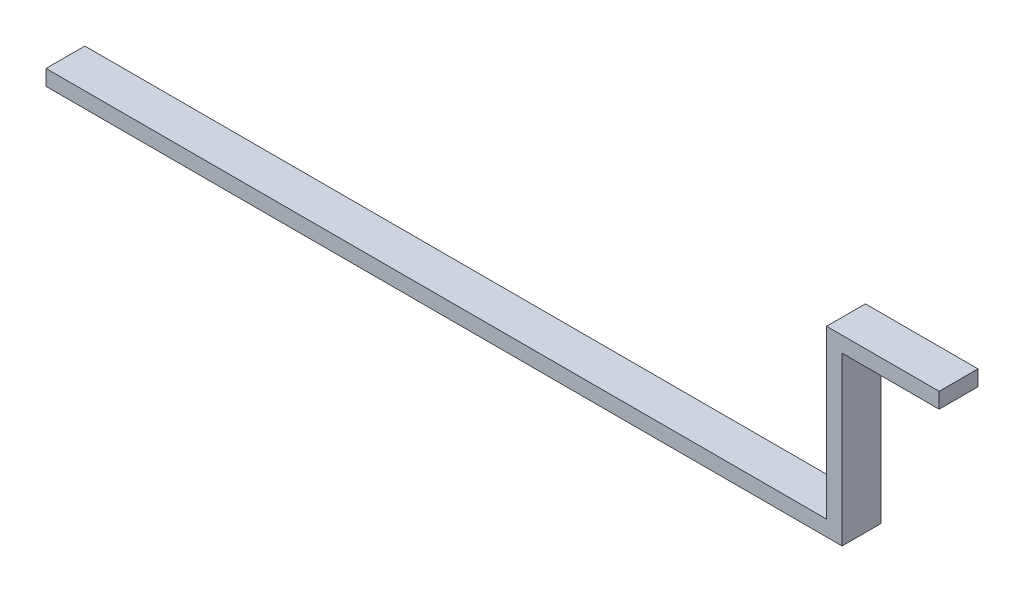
ISO-10303-21;
HEADER;
FILE_DESCRIPTION(('STEP AP214'),'2;1');
FILE_NAME('part.step','',(''),(''),'','','');
FILE_SCHEMA(('AUTOMOTIVE_DESIGN { 1 0 10303 214 1 1 1 1 }'));
ENDSEC;
DATA;
#1=APPLICATION_CONTEXT('core data for automotive mechanical design processes');
#2=APPLICATION_PROTOCOL_DEFINITION('international standard','automotive_design',2000,#1);
#3=PRODUCT_CONTEXT('',#1,'mechanical');
#4=PRODUCT('Part','Part','',(#3));
#5=PRODUCT_RELATED_PRODUCT_CATEGORY('part','',(#4));
#6=PRODUCT_DEFINITION_FORMATION('','',#4);
#7=PRODUCT_DEFINITION_CONTEXT('part definition',#1,'design');
#8=PRODUCT_DEFINITION('design','',#6,#7);
#9=PRODUCT_DEFINITION_SHAPE('','',#8);
#10=(LENGTH_UNIT() NAMED_UNIT(*) SI_UNIT(.MILLI.,.METRE.));
#11=(NAMED_UNIT(*) PLANE_ANGLE_UNIT() SI_UNIT($,.RADIAN.));
#12=(NAMED_UNIT(*) SI_UNIT($,.STERADIAN.) SOLID_ANGLE_UNIT());
#13=UNCERTAINTY_MEASURE_WITH_UNIT(LENGTH_MEASURE(1.E-05),#10,'distance_accuracy_value','');
#14=(GEOMETRIC_REPRESENTATION_CONTEXT(3) GLOBAL_UNCERTAINTY_ASSIGNED_CONTEXT((#13)) GLOBAL_UNIT_ASSIGNED_CONTEXT((#10,
#11,#12)) REPRESENTATION_CONTEXT('',''));
#15=CARTESIAN_POINT('',(0.,0.,0.));
#16=DIRECTION('',(0.,0.,1.));
#17=DIRECTION('',(1.,0.,0.));
#18=AXIS2_PLACEMENT_3D('',#15,#16,#17);
#19=CARTESIAN_POINT('',(45.,12.6,1.));
#20=DIRECTION('',(-1.,0.,0.));
#21=DIRECTION('',(0.,0.,1.));
#22=AXIS2_PLACEMENT_3D('',#19,#20,#21);
#23=PLANE('',#22);
#24=DIRECTION('',(0.,1.,0.));
#25=VECTOR('',#24,1.);
#26=CARTESIAN_POINT('',(45.,12.6,-1.));
#27=LINE('',#26,#25);
#28=CARTESIAN_POINT('',(45.,12.6,-1.));
#29=VERTEX_POINT('',#28);
#30=CARTESIAN_POINT('',(45.,13.4,-1.));
#31=VERTEX_POINT('',#30);
#32=EDGE_CURVE('E127',#29,#31,#27,.T.);
#33=ORIENTED_EDGE('',*,*,#32,.T.);
#34=DIRECTION('',(0.,0.,-1.));
#35=VECTOR('',#34,1.);
#36=CARTESIAN_POINT('',(45.,13.4,1.));
#37=LINE('',#36,#35);
#38=CARTESIAN_POINT('',(45.,13.4,1.));
#39=VERTEX_POINT('',#38);
#40=EDGE_CURVE('E11',#39,#31,#37,.T.);
#41=ORIENTED_EDGE('',*,*,#40,.F.);
#42=DIRECTION('',(0.,1.,0.));
#43=VECTOR('',#42,1.);
#44=CARTESIAN_POINT('',(45.,12.6,1.));
#45=LINE('',#44,#43);
#46=CARTESIAN_POINT('',(45.,12.6,1.));
#47=VERTEX_POINT('',#46);
#48=EDGE_CURVE('E141',#47,#39,#45,.T.);
#49=ORIENTED_EDGE('',*,*,#48,.F.);
#50=DIRECTION('',(0.,0.,-1.));
#51=VECTOR('',#50,1.);
#52=CARTESIAN_POINT('',(45.,12.6,1.));
#53=LINE('',#52,#51);
#54=EDGE_CURVE('E123',#47,#29,#53,.T.);
#55=ORIENTED_EDGE('',*,*,#54,.T.);
#56=EDGE_LOOP('',(#33,#41,#49,#55));
#57=FACE_BOUND('',#56,.T.);
#58=ADVANCED_FACE('F31',(#57),#23,.F.);
#59=CARTESIAN_POINT('',(45.,13.4,1.));
#60=DIRECTION('',(0.,-1.,0.));
#61=DIRECTION('',(1.,0.,0.));
#62=AXIS2_PLACEMENT_3D('',#59,#60,#61);
#63=PLANE('',#62);
#64=DIRECTION('',(-1.,0.,0.));
#65=VECTOR('',#64,1.);
#66=CARTESIAN_POINT('',(45.,13.4,-1.));
#67=LINE('',#66,#65);
#68=CARTESIAN_POINT('',(39.2,13.4,-1.));
#69=VERTEX_POINT('',#68);
#70=EDGE_CURVE('E130',#31,#69,#67,.T.);
#71=ORIENTED_EDGE('',*,*,#70,.T.);
#72=DIRECTION('',(0.,0.,-1.));
#73=VECTOR('',#72,1.);
#74=CARTESIAN_POINT('',(39.2,13.4,1.));
#75=LINE('',#74,#73);
#76=CARTESIAN_POINT('',(39.2,13.4,1.));
#77=VERTEX_POINT('',#76);
#78=EDGE_CURVE('E39',#77,#69,#75,.T.);
#79=ORIENTED_EDGE('',*,*,#78,.F.);
#80=DIRECTION('',(-1.,0.,0.));
#81=VECTOR('',#80,1.);
#82=CARTESIAN_POINT('',(45.,13.4,1.));
#83=LINE('',#82,#81);
#84=EDGE_CURVE('E90',#39,#77,#83,.T.);
#85=ORIENTED_EDGE('',*,*,#84,.F.);
#86=ORIENTED_EDGE('',*,*,#40,.T.);
#87=EDGE_LOOP('',(#71,#79,#85,#86));
#88=FACE_BOUND('',#87,.T.);
#89=ADVANCED_FACE('F176',(#88),#63,.F.);
#90=CARTESIAN_POINT('',(39.2,13.4,1.));
#91=DIRECTION('',(1.,0.,0.));
#92=DIRECTION('',(0.,0.,-1.));
#93=AXIS2_PLACEMENT_3D('',#90,#91,#92);
#94=PLANE('',#93);
#95=DIRECTION('',(0.,-1.,0.));
#96=VECTOR('',#95,1.);
#97=CARTESIAN_POINT('',(39.2,13.4,-1.));
#98=LINE('',#97,#96);
#99=CARTESIAN_POINT('',(39.2,4.8,-1.));
#100=VERTEX_POINT('',#99);
#101=EDGE_CURVE('E132',#69,#100,#98,.T.);
#102=ORIENTED_EDGE('',*,*,#101,.T.);
#103=DIRECTION('',(0.,0.,-1.));
#104=VECTOR('',#103,1.);
#105=CARTESIAN_POINT('',(39.2,4.8,1.));
#106=LINE('',#105,#104);
#107=CARTESIAN_POINT('',(39.2,4.8,1.));
#108=VERTEX_POINT('',#107);
#109=EDGE_CURVE('E148',#108,#100,#106,.T.);
#110=ORIENTED_EDGE('',*,*,#109,.F.);
#111=DIRECTION('',(0.,-1.,0.));
#112=VECTOR('',#111,1.);
#113=CARTESIAN_POINT('',(39.2,13.4,1.));
#114=LINE('',#113,#112);
#115=EDGE_CURVE('E156',#77,#108,#114,.T.);
#116=ORIENTED_EDGE('',*,*,#115,.F.);
#117=ORIENTED_EDGE('',*,*,#78,.T.);
#118=EDGE_LOOP('',(#102,#110,#116,#117));
#119=FACE_BOUND('',#118,.T.);
#120=ADVANCED_FACE('F154',(#119),#94,.F.);
#121=CARTESIAN_POINT('',(39.2,4.8,1.));
#122=DIRECTION('',(0.,-1.,0.));
#123=DIRECTION('',(1.,0.,0.));
#124=AXIS2_PLACEMENT_3D('',#121,#122,#123);
#125=PLANE('',#124);
#126=DIRECTION('',(-1.,0.,0.));
#127=VECTOR('',#126,1.);
#128=CARTESIAN_POINT('',(39.2,4.8,-1.));
#129=LINE('',#128,#127);
#130=CARTESIAN_POINT('',(-1.00000000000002,4.8,-1.));
#131=VERTEX_POINT('',#130);
#132=EDGE_CURVE('E134',#100,#131,#129,.T.);
#133=ORIENTED_EDGE('',*,*,#132,.T.);
#134=DIRECTION('',(0.,0.,-1.));
#135=VECTOR('',#134,1.);
#136=CARTESIAN_POINT('',(-1.00000000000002,4.8,1.));
#137=LINE('',#136,#135);
#138=CARTESIAN_POINT('',(-1.00000000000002,4.8,1.));
#139=VERTEX_POINT('',#138);
#140=EDGE_CURVE('E145',#139,#131,#137,.T.);
#141=ORIENTED_EDGE('',*,*,#140,.F.);
#142=DIRECTION('',(-1.,0.,0.));
#143=VECTOR('',#142,1.);
#144=CARTESIAN_POINT('',(39.2,4.8,1.));
#145=LINE('',#144,#143);
#146=EDGE_CURVE('E168',#108,#139,#145,.T.);
#147=ORIENTED_EDGE('',*,*,#146,.F.);
#148=ORIENTED_EDGE('',*,*,#109,.T.);
#149=EDGE_LOOP('',(#133,#141,#147,#148));
#150=FACE_BOUND('',#149,.T.);
#151=ADVANCED_FACE('F164',(#150),#125,.F.);
#152=CARTESIAN_POINT('',(-1.00000000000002,4.8,1.));
#153=DIRECTION('',(1.,0.,0.));
#154=DIRECTION('',(0.,0.,-1.));
#155=AXIS2_PLACEMENT_3D('',#152,#153,#154);
#156=PLANE('',#155);
#157=DIRECTION('',(0.,-1.,0.));
#158=VECTOR('',#157,1.);
#159=CARTESIAN_POINT('',(-1.00000000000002,4.8,-1.));
#160=LINE('',#159,#158);
#161=CARTESIAN_POINT('',(-1.00000000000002,4.,-1.));
#162=VERTEX_POINT('',#161);
#163=EDGE_CURVE('E136',#131,#162,#160,.T.);
#164=ORIENTED_EDGE('',*,*,#163,.T.);
#165=DIRECTION('',(0.,0.,-1.));
#166=VECTOR('',#165,1.);
#167=CARTESIAN_POINT('',(-1.00000000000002,4.,1.));
#168=LINE('',#167,#166);
#169=CARTESIAN_POINT('',(-1.00000000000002,4.,1.));
#170=VERTEX_POINT('',#169);
#171=EDGE_CURVE('E118',#170,#162,#168,.T.);
#172=ORIENTED_EDGE('',*,*,#171,.F.);
#173=DIRECTION('',(0.,-1.,0.));
#174=VECTOR('',#173,1.);
#175=CARTESIAN_POINT('',(-1.00000000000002,4.8,1.));
#176=LINE('',#175,#174);
#177=EDGE_CURVE('E109',#139,#170,#176,.T.);
#178=ORIENTED_EDGE('',*,*,#177,.F.);
#179=ORIENTED_EDGE('',*,*,#140,.T.);
#180=EDGE_LOOP('',(#164,#172,#178,#179));
#181=FACE_BOUND('',#180,.T.);
#182=ADVANCED_FACE('F167',(#181),#156,.F.);
#183=CARTESIAN_POINT('',(-1.00000000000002,4.,1.));
#184=DIRECTION('',(0.,1.,0.));
#185=DIRECTION('',(0.,0.,1.));
#186=AXIS2_PLACEMENT_3D('',#183,#184,#185);
#187=PLANE('',#186);
#188=DIRECTION('',(1.,0.,0.));
#189=VECTOR('',#188,1.);
#190=CARTESIAN_POINT('',(-1.00000000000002,4.,-1.));
#191=LINE('',#190,#189);
#192=CARTESIAN_POINT('',(40.,4.,-1.));
#193=VERTEX_POINT('',#192);
#194=EDGE_CURVE('E117',#162,#193,#191,.T.);
#195=ORIENTED_EDGE('',*,*,#194,.T.);
#196=DIRECTION('',(0.,0.,-1.));
#197=VECTOR('',#196,1.);
#198=CARTESIAN_POINT('',(40.,4.,1.));
#199=LINE('',#198,#197);
#200=CARTESIAN_POINT('',(40.,4.,1.));
#201=VERTEX_POINT('',#200);
#202=EDGE_CURVE('E114',#201,#193,#199,.T.);
#203=ORIENTED_EDGE('',*,*,#202,.F.);
#204=DIRECTION('',(1.,0.,0.));
#205=VECTOR('',#204,1.);
#206=CARTESIAN_POINT('',(-1.00000000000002,4.,1.));
#207=LINE('',#206,#205);
#208=EDGE_CURVE('E103',#170,#201,#207,.T.);
#209=ORIENTED_EDGE('',*,*,#208,.F.);
#210=ORIENTED_EDGE('',*,*,#171,.T.);
#211=EDGE_LOOP('',(#195,#203,#209,#210));
#212=FACE_BOUND('',#211,.T.);
#213=ADVANCED_FACE('F115',(#212),#187,.F.);
#214=CARTESIAN_POINT('',(40.,4.,1.));
#215=DIRECTION('',(-1.,0.,0.));
#216=DIRECTION('',(0.,0.,1.));
#217=AXIS2_PLACEMENT_3D('',#214,#215,#216);
#218=PLANE('',#217);
#219=DIRECTION('',(0.,1.,0.));
#220=VECTOR('',#219,1.);
#221=CARTESIAN_POINT('',(40.,4.,-1.));
#222=LINE('',#221,#220);
#223=CARTESIAN_POINT('',(40.,12.6,-1.));
#224=VERTEX_POINT('',#223);
#225=EDGE_CURVE('E76',#193,#224,#222,.T.);
#226=ORIENTED_EDGE('',*,*,#225,.T.);
#227=DIRECTION('',(0.,0.,-1.));
#228=VECTOR('',#227,1.);
#229=CARTESIAN_POINT('',(40.,12.6,1.));
#230=LINE('',#229,#228);
#231=CARTESIAN_POINT('',(40.,12.6,1.));
#232=VERTEX_POINT('',#231);
#233=EDGE_CURVE('E119',#232,#224,#230,.T.);
#234=ORIENTED_EDGE('',*,*,#233,.F.);
#235=DIRECTION('',(0.,1.,0.));
#236=VECTOR('',#235,1.);
#237=CARTESIAN_POINT('',(40.,4.,1.));
#238=LINE('',#237,#236);
#239=EDGE_CURVE('E107',#201,#232,#238,.T.);
#240=ORIENTED_EDGE('',*,*,#239,.F.);
#241=ORIENTED_EDGE('',*,*,#202,.T.);
#242=EDGE_LOOP('',(#226,#234,#240,#241));
#243=FACE_BOUND('',#242,.T.);
#244=ADVANCED_FACE('F121',(#243),#218,.F.);
#245=CARTESIAN_POINT('',(40.,12.6,1.));
#246=DIRECTION('',(0.,1.,0.));
#247=DIRECTION('',(0.,0.,1.));
#248=AXIS2_PLACEMENT_3D('',#245,#246,#247);
#249=PLANE('',#248);
#250=DIRECTION('',(1.,0.,0.));
#251=VECTOR('',#250,1.);
#252=CARTESIAN_POINT('',(40.,12.6,-1.));
#253=LINE('',#252,#251);
#254=EDGE_CURVE('E82',#224,#29,#253,.T.);
#255=ORIENTED_EDGE('',*,*,#254,.T.);
#256=ORIENTED_EDGE('',*,*,#54,.F.);
#257=DIRECTION('',(1.,0.,0.));
#258=VECTOR('',#257,1.);
#259=CARTESIAN_POINT('',(40.,12.6,1.));
#260=LINE('',#259,#258);
#261=EDGE_CURVE('E47',#232,#47,#260,.T.);
#262=ORIENTED_EDGE('',*,*,#261,.F.);
#263=ORIENTED_EDGE('',*,*,#233,.T.);
#264=EDGE_LOOP('',(#255,#256,#262,#263));
#265=FACE_BOUND('',#264,.T.);
#266=ADVANCED_FACE('F192',(#265),#249,.F.);
#267=CARTESIAN_POINT('',(45.,4.,1.));
#268=DIRECTION('',(0.,0.,-1.));
#269=DIRECTION('',(-1.,0.,0.));
#270=AXIS2_PLACEMENT_3D('',#267,#268,#269);
#271=PLANE('',#270);
#272=ORIENTED_EDGE('',*,*,#48,.T.);
#273=ORIENTED_EDGE('',*,*,#84,.T.);
#274=ORIENTED_EDGE('',*,*,#115,.T.);
#275=ORIENTED_EDGE('',*,*,#146,.T.);
#276=ORIENTED_EDGE('',*,*,#177,.T.);
#277=ORIENTED_EDGE('',*,*,#208,.T.);
#278=ORIENTED_EDGE('',*,*,#239,.T.);
#279=ORIENTED_EDGE('',*,*,#261,.T.);
#280=EDGE_LOOP('',(#272,#273,#274,#275,#276,#277,#278,#279));
#281=FACE_BOUND('',#280,.T.);
#282=ADVANCED_FACE('F105',(#281),#271,.F.);
#283=CARTESIAN_POINT('',(45.,4.,-1.));
#284=DIRECTION('',(0.,0.,-1.));
#285=DIRECTION('',(-1.,0.,0.));
#286=AXIS2_PLACEMENT_3D('',#283,#284,#285);
#287=PLANE('',#286);
#288=ORIENTED_EDGE('',*,*,#32,.F.);
#289=ORIENTED_EDGE('',*,*,#254,.F.);
#290=ORIENTED_EDGE('',*,*,#225,.F.);
#291=ORIENTED_EDGE('',*,*,#194,.F.);
#292=ORIENTED_EDGE('',*,*,#163,.F.);
#293=ORIENTED_EDGE('',*,*,#132,.F.);
#294=ORIENTED_EDGE('',*,*,#101,.F.);
#295=ORIENTED_EDGE('',*,*,#70,.F.);
#296=EDGE_LOOP('',(#288,#289,#290,#291,#292,#293,#294,#295));
#297=FACE_BOUND('',#296,.T.);
#298=ADVANCED_FACE('F160',(#297),#287,.T.);
#299=CLOSED_SHELL('',(#58,#89,#120,#151,#182,#213,#244,#266,#282,#298));
#300=MANIFOLD_SOLID_BREP('B2',#299);
#301=ADVANCED_BREP_SHAPE_REPRESENTATION('',(#18,#300),#14);
#302=SHAPE_DEFINITION_REPRESENTATION(#9,#301);
ENDSEC;
END-ISO-10303-21;
